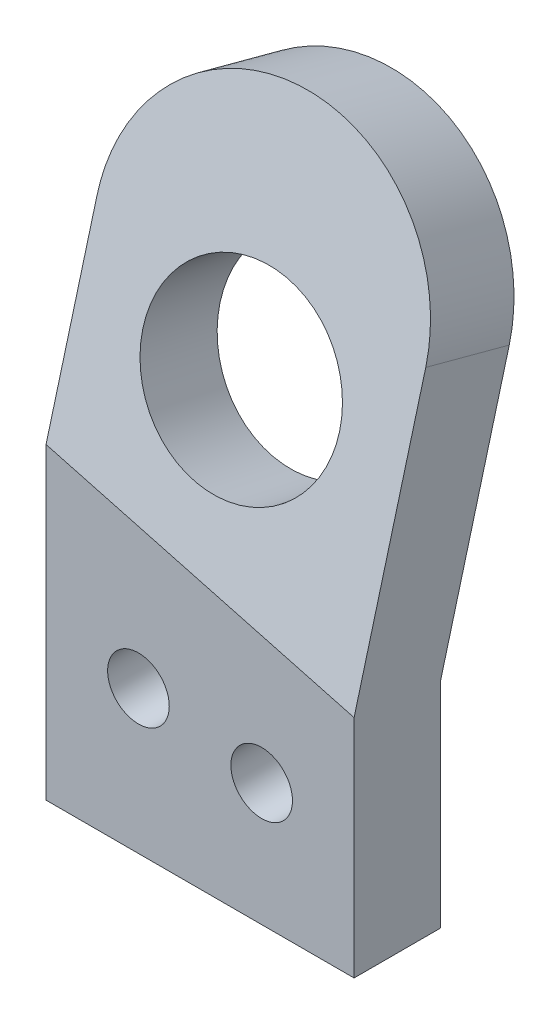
ISO-10303-21;
HEADER;
FILE_DESCRIPTION(('STEP AP214'),'2;1');
FILE_NAME('part.step','',(''),(''),'','','');
FILE_SCHEMA(('AUTOMOTIVE_DESIGN { 1 0 10303 214 1 1 1 1 }'));
ENDSEC;
DATA;
#1=APPLICATION_CONTEXT('core data for automotive mechanical design processes');
#2=APPLICATION_PROTOCOL_DEFINITION('international standard','automotive_design',2000,#1);
#3=PRODUCT_CONTEXT('',#1,'mechanical');
#4=PRODUCT('Part','Part','',(#3));
#5=PRODUCT_RELATED_PRODUCT_CATEGORY('part','',(#4));
#6=PRODUCT_DEFINITION_FORMATION('','',#4);
#7=PRODUCT_DEFINITION_CONTEXT('part definition',#1,'design');
#8=PRODUCT_DEFINITION('design','',#6,#7);
#9=PRODUCT_DEFINITION_SHAPE('','',#8);
#10=(LENGTH_UNIT() NAMED_UNIT(*) SI_UNIT(.MILLI.,.METRE.));
#11=(NAMED_UNIT(*) PLANE_ANGLE_UNIT() SI_UNIT($,.RADIAN.));
#12=(NAMED_UNIT(*) SI_UNIT($,.STERADIAN.) SOLID_ANGLE_UNIT());
#13=UNCERTAINTY_MEASURE_WITH_UNIT(LENGTH_MEASURE(1.E-05),#10,'distance_accuracy_value','');
#14=(GEOMETRIC_REPRESENTATION_CONTEXT(3) GLOBAL_UNCERTAINTY_ASSIGNED_CONTEXT((#13)) GLOBAL_UNIT_ASSIGNED_CONTEXT((#10,
#11,#12)) REPRESENTATION_CONTEXT('',''));
#15=CARTESIAN_POINT('',(0.,0.,0.));
#16=DIRECTION('',(0.,0.,1.));
#17=DIRECTION('',(1.,0.,0.));
#18=AXIS2_PLACEMENT_3D('',#15,#16,#17);
#19=CARTESIAN_POINT('',(-25.,26.3799971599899,-0.187016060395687));
#20=DIRECTION('',(0.,0.258819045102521,0.965925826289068));
#21=DIRECTION('',(0.,-0.965925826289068,0.258819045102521));
#22=AXIS2_PLACEMENT_3D('',#19,#20,#21);
#23=CYLINDRICAL_SURFACE('',#22,25.);
#24=DIRECTION('',(0.,-0.258819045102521,-0.965925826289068));
#25=VECTOR('',#24,1.);
#26=CARTESIAN_POINT('',(0.,26.3799971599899,-0.187016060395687));
#27=LINE('',#26,#25);
#28=CARTESIAN_POINT('',(0.,26.3799971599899,-0.187016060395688));
#29=VERTEX_POINT('',#28);
#30=CARTESIAN_POINT('',(0.,30.0121668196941,13.3684256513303));
#31=VERTEX_POINT('',#30);
#32=EDGE_CURVE('E125',#29,#31,#27,.F.);
#33=ORIENTED_EDGE('',*,*,#32,.F.);
#34=CARTESIAN_POINT('',(-25.,26.828726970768,1.48766639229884));
#35=DIRECTION('',(0.0691841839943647,0.258198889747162,0.96361137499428));
#36=DIRECTION('',(-0.997603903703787,0.0179061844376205,0.0668267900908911));
#37=AXIS2_PLACEMENT_3D('',#34,#35,#36);
#38=ELLIPSE('',#37,25.0600462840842,25.);
#39=CARTESIAN_POINT('',(-50.,27.2774567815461,3.16234884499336));
#40=VERTEX_POINT('',#39);
#41=EDGE_CURVE('E41',#40,#29,#38,.F.);
#42=ORIENTED_EDGE('',*,*,#41,.F.);
#43=DIRECTION('',(0.,0.258819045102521,0.965925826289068));
#44=VECTOR('',#43,1.);
#45=CARTESIAN_POINT('',(-50.,21.3102615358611,-19.1075269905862));
#46=LINE('',#45,#44);
#47=CARTESIAN_POINT('',(-50.,30.9096264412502,16.7177905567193));
#48=VERTEX_POINT('',#47);
#49=EDGE_CURVE('E128',#48,#40,#46,.F.);
#50=ORIENTED_EDGE('',*,*,#49,.F.);
#51=CARTESIAN_POINT('',(-25.,30.4608966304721,15.0431081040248));
#52=DIRECTION('',(0.0691841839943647,0.258198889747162,0.96361137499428));
#53=DIRECTION('',(-0.997603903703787,0.0179061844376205,0.0668267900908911));
#54=AXIS2_PLACEMENT_3D('',#51,#52,#53);
#55=ELLIPSE('',#54,25.0600462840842,25.);
#56=EDGE_CURVE('E11',#31,#48,#55,.T.);
#57=ORIENTED_EDGE('',*,*,#56,.F.);
#58=EDGE_LOOP('',(#33,#42,#50,#57));
#59=FACE_BOUND('',#58,.T.);
#60=ADVANCED_FACE('F33',(#59),#23,.T.);
#61=CARTESIAN_POINT('',(0.,-50.,0.));
#62=DIRECTION('',(-1.,0.,0.));
#63=DIRECTION('',(0.,0.,1.));
#64=AXIS2_PLACEMENT_3D('',#61,#62,#63);
#65=PLANE('',#64);
#66=DIRECTION('',(0.,-0.965925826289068,0.258819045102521));
#67=VECTOR('',#66,1.);
#68=CARTESIAN_POINT('',(0.,-17.0296292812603,11.444558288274));
#69=LINE('',#68,#67);
#70=CARTESIAN_POINT('',(0.,-15.3705151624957,11.));
#71=VERTEX_POINT('',#70);
#72=EDGE_CURVE('E96',#29,#71,#69,.T.);
#73=ORIENTED_EDGE('',*,*,#72,.F.);
#74=ORIENTED_EDGE('',*,*,#32,.T.);
#75=DIRECTION('',(0.,-0.965925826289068,0.258819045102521));
#76=VECTOR('',#75,1.);
#77=CARTESIAN_POINT('',(0.,-13.3974596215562,25.));
#78=LINE('',#77,#76);
#79=CARTESIAN_POINT('',(0.,-13.3974596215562,25.));
#80=VERTEX_POINT('',#79);
#81=EDGE_CURVE('E116',#31,#80,#78,.T.);
#82=ORIENTED_EDGE('',*,*,#81,.T.);
#83=DIRECTION('',(0.,-1.,0.));
#84=VECTOR('',#83,1.);
#85=CARTESIAN_POINT('',(0.,-50.,25.));
#86=LINE('',#85,#84);
#87=CARTESIAN_POINT('',(0.,-50.,25.));
#88=VERTEX_POINT('',#87);
#89=EDGE_CURVE('E110',#80,#88,#86,.T.);
#90=ORIENTED_EDGE('',*,*,#89,.T.);
#91=DIRECTION('',(0.,0.,-1.));
#92=VECTOR('',#91,1.);
#93=CARTESIAN_POINT('',(0.,-50.,0.));
#94=LINE('',#93,#92);
#95=CARTESIAN_POINT('',(0.,-50.,11.));
#96=VERTEX_POINT('',#95);
#97=EDGE_CURVE('E102',#88,#96,#94,.T.);
#98=ORIENTED_EDGE('',*,*,#97,.T.);
#99=DIRECTION('',(0.,-1.,0.));
#100=VECTOR('',#99,1.);
#101=CARTESIAN_POINT('',(0.,-50.,11.));
#102=LINE('',#101,#100);
#103=EDGE_CURVE('E84',#71,#96,#102,.T.);
#104=ORIENTED_EDGE('',*,*,#103,.F.);
#105=EDGE_LOOP('',(#73,#74,#82,#90,#98,#104));
#106=FACE_BOUND('',#105,.T.);
#107=ADVANCED_FACE('F108',(#106),#65,.F.);
#108=CARTESIAN_POINT('',(-50.,-50.,0.));
#109=DIRECTION('',(0.,-1.,0.));
#110=DIRECTION('',(0.,0.,-1.));
#111=AXIS2_PLACEMENT_3D('',#108,#109,#110);
#112=PLANE('',#111);
#113=DIRECTION('',(0.,0.,-1.));
#114=VECTOR('',#113,1.);
#115=CARTESIAN_POINT('',(-50.,-50.,0.));
#116=LINE('',#115,#114);
#117=CARTESIAN_POINT('',(-50.,-50.,25.));
#118=VERTEX_POINT('',#117);
#119=CARTESIAN_POINT('',(-50.,-50.,11.));
#120=VERTEX_POINT('',#119);
#121=EDGE_CURVE('E104',#118,#120,#116,.T.);
#122=ORIENTED_EDGE('',*,*,#121,.T.);
#123=DIRECTION('',(1.,0.,0.));
#124=VECTOR('',#123,1.);
#125=CARTESIAN_POINT('',(-50.,-50.,11.));
#126=LINE('',#125,#124);
#127=EDGE_CURVE('E88',#120,#96,#126,.T.);
#128=ORIENTED_EDGE('',*,*,#127,.T.);
#129=ORIENTED_EDGE('',*,*,#97,.F.);
#130=DIRECTION('',(1.,0.,0.));
#131=VECTOR('',#130,1.);
#132=CARTESIAN_POINT('',(-50.,-50.,25.));
#133=LINE('',#132,#131);
#134=EDGE_CURVE('E123',#118,#88,#133,.T.);
#135=ORIENTED_EDGE('',*,*,#134,.F.);
#136=EDGE_LOOP('',(#122,#128,#129,#135));
#137=FACE_BOUND('',#136,.T.);
#138=ADVANCED_FACE('F101',(#137),#112,.T.);
#139=CARTESIAN_POINT('',(-50.,-50.,0.));
#140=DIRECTION('',(-1.,0.,0.));
#141=DIRECTION('',(0.,0.,1.));
#142=AXIS2_PLACEMENT_3D('',#139,#140,#141);
#143=PLANE('',#142);
#144=DIRECTION('',(0.,-0.965925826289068,0.258819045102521));
#145=VECTOR('',#144,1.);
#146=CARTESIAN_POINT('',(-50.,0.,25.));
#147=LINE('',#146,#145);
#148=CARTESIAN_POINT('',(-50.,0.,25.));
#149=VERTEX_POINT('',#148);
#150=EDGE_CURVE('E112',#48,#149,#147,.T.);
#151=ORIENTED_EDGE('',*,*,#150,.F.);
#152=ORIENTED_EDGE('',*,*,#49,.T.);
#153=DIRECTION('',(0.,-0.965925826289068,0.258819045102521));
#154=VECTOR('',#153,1.);
#155=CARTESIAN_POINT('',(-50.,-16.1321696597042,14.7939231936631));
#156=LINE('',#155,#154);
#157=CARTESIAN_POINT('',(-50.,-1.97305554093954,11.));
#158=VERTEX_POINT('',#157);
#159=EDGE_CURVE('E95',#40,#158,#156,.T.);
#160=ORIENTED_EDGE('',*,*,#159,.T.);
#161=DIRECTION('',(0.,-1.,0.));
#162=VECTOR('',#161,1.);
#163=CARTESIAN_POINT('',(-50.,-50.,11.));
#164=LINE('',#163,#162);
#165=EDGE_CURVE('E106',#158,#120,#164,.T.);
#166=ORIENTED_EDGE('',*,*,#165,.T.);
#167=ORIENTED_EDGE('',*,*,#121,.F.);
#168=DIRECTION('',(0.,-1.,0.));
#169=VECTOR('',#168,1.);
#170=CARTESIAN_POINT('',(-50.,-50.,25.));
#171=LINE('',#170,#169);
#172=EDGE_CURVE('E114',#149,#118,#171,.T.);
#173=ORIENTED_EDGE('',*,*,#172,.F.);
#174=EDGE_LOOP('',(#151,#152,#160,#166,#167,#173));
#175=FACE_BOUND('',#174,.T.);
#176=ADVANCED_FACE('F161',(#175),#143,.T.);
#177=CARTESIAN_POINT('',(-50.,-50.,25.));
#178=DIRECTION('',(0.,0.,1.));
#179=DIRECTION('',(1.,0.,0.));
#180=AXIS2_PLACEMENT_3D('',#177,#178,#179);
#181=PLANE('',#180);
#182=CARTESIAN_POINT('',(-35.,-26.7953138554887,25.));
#183=DIRECTION('',(0.,0.,1.));
#184=DIRECTION('',(1.,0.,0.));
#185=AXIS2_PLACEMENT_3D('',#182,#183,#184);
#186=CIRCLE('',#185,5.);
#187=CARTESIAN_POINT('',(-30.,-26.7953138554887,25.));
#188=VERTEX_POINT('',#187);
#189=EDGE_CURVE('E146',#188,#188,#186,.T.);
#190=ORIENTED_EDGE('',*,*,#189,.F.);
#191=EDGE_LOOP('',(#190));
#192=FACE_BOUND('',#191,.T.);
#193=CARTESIAN_POINT('',(-15.,-30.083745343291,25.));
#194=DIRECTION('',(0.,0.,1.));
#195=DIRECTION('',(1.,0.,0.));
#196=AXIS2_PLACEMENT_3D('',#193,#194,#195);
#197=CIRCLE('',#196,5.);
#198=CARTESIAN_POINT('',(-10.,-30.083745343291,25.));
#199=VERTEX_POINT('',#198);
#200=EDGE_CURVE('E136',#199,#199,#197,.T.);
#201=ORIENTED_EDGE('',*,*,#200,.F.);
#202=EDGE_LOOP('',(#201));
#203=FACE_BOUND('',#202,.T.);
#204=ORIENTED_EDGE('',*,*,#89,.F.);
#205=DIRECTION('',(-0.965925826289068,0.258819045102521,0.));
#206=VECTOR('',#205,1.);
#207=CARTESIAN_POINT('',(-50.,0.,25.));
#208=LINE('',#207,#206);
#209=EDGE_CURVE('E105',#80,#149,#208,.T.);
#210=ORIENTED_EDGE('',*,*,#209,.T.);
#211=ORIENTED_EDGE('',*,*,#172,.T.);
#212=ORIENTED_EDGE('',*,*,#134,.T.);
#213=EDGE_LOOP('',(#204,#210,#211,#212));
#214=FACE_BOUND('',#213,.T.);
#215=ADVANCED_FACE('F159',(#192,#203,#214),#181,.T.);
#216=CARTESIAN_POINT('',(0.,-13.3974596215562,25.));
#217=DIRECTION('',(0.0691841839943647,0.258198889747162,0.96361137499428));
#218=DIRECTION('',(0.,-0.965925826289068,0.258819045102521));
#219=AXIS2_PLACEMENT_3D('',#216,#217,#218);
#220=PLANE('',#219);
#221=CARTESIAN_POINT('',(-25.,18.2413677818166,18.3173209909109));
#222=DIRECTION('',(0.0691841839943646,0.258198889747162,0.96361137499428));
#223=DIRECTION('',(0.,-0.965925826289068,0.258819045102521));
#224=AXIS2_PLACEMENT_3D('',#221,#222,#223);
#225=CIRCLE('',#224,15.);
#226=CARTESIAN_POINT('',(-25.,3.75248038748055,22.1996066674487));
#227=VERTEX_POINT('',#226);
#228=EDGE_CURVE('E133',#227,#227,#225,.T.);
#229=ORIENTED_EDGE('',*,*,#228,.F.);
#230=EDGE_LOOP('',(#229));
#231=FACE_BOUND('',#230,.T.);
#232=ORIENTED_EDGE('',*,*,#81,.F.);
#233=ORIENTED_EDGE('',*,*,#56,.T.);
#234=ORIENTED_EDGE('',*,*,#150,.T.);
#235=ORIENTED_EDGE('',*,*,#209,.F.);
#236=EDGE_LOOP('',(#232,#233,#234,#235));
#237=FACE_BOUND('',#236,.T.);
#238=ADVANCED_FACE('F155',(#231,#237),#220,.T.);
#239=CARTESIAN_POINT('',(-50.,-50.,11.));
#240=DIRECTION('',(0.,0.,1.));
#241=DIRECTION('',(1.,0.,0.));
#242=AXIS2_PLACEMENT_3D('',#239,#240,#241);
#243=PLANE('',#242);
#244=CARTESIAN_POINT('',(-35.,-26.7953138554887,11.));
#245=DIRECTION('',(0.,0.,1.));
#246=DIRECTION('',(1.,0.,0.));
#247=AXIS2_PLACEMENT_3D('',#244,#245,#246);
#248=CIRCLE('',#247,4.99999999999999);
#249=CARTESIAN_POINT('',(-30.,-26.7953138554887,11.));
#250=VERTEX_POINT('',#249);
#251=EDGE_CURVE('E36',#250,#250,#248,.T.);
#252=ORIENTED_EDGE('',*,*,#251,.T.);
#253=EDGE_LOOP('',(#252));
#254=FACE_BOUND('',#253,.T.);
#255=CARTESIAN_POINT('',(-15.,-30.083745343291,11.));
#256=DIRECTION('',(0.,0.,1.));
#257=DIRECTION('',(1.,0.,0.));
#258=AXIS2_PLACEMENT_3D('',#255,#256,#257);
#259=CIRCLE('',#258,4.99999999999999);
#260=CARTESIAN_POINT('',(-10.,-30.083745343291,11.));
#261=VERTEX_POINT('',#260);
#262=EDGE_CURVE('E134',#261,#261,#259,.T.);
#263=ORIENTED_EDGE('',*,*,#262,.T.);
#264=EDGE_LOOP('',(#263));
#265=FACE_BOUND('',#264,.T.);
#266=ORIENTED_EDGE('',*,*,#103,.T.);
#267=ORIENTED_EDGE('',*,*,#127,.F.);
#268=ORIENTED_EDGE('',*,*,#165,.F.);
#269=DIRECTION('',(-0.965925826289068,0.258819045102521,0.));
#270=VECTOR('',#269,1.);
#271=CARTESIAN_POINT('',(-37.9932638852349,-5.19025078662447,11.));
#272=LINE('',#271,#270);
#273=EDGE_CURVE('E91',#71,#158,#272,.T.);
#274=ORIENTED_EDGE('',*,*,#273,.F.);
#275=EDGE_LOOP('',(#266,#267,#268,#274));
#276=FACE_BOUND('',#275,.T.);
#277=ADVANCED_FACE('F86',(#254,#265,#276),#243,.F.);
#278=CARTESIAN_POINT('',(-0.968578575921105,-17.0122440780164,11.5094407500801));
#279=DIRECTION('',(0.0691841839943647,0.258198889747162,0.96361137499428));
#280=DIRECTION('',(0.,-0.965925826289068,0.258819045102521));
#281=AXIS2_PLACEMENT_3D('',#278,#279,#280);
#282=PLANE('',#281);
#283=CARTESIAN_POINT('',(-25.9685785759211,14.6265833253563,4.82676174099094));
#284=DIRECTION('',(0.0691841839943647,0.258198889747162,0.96361137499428));
#285=DIRECTION('',(0.,-0.965925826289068,0.258819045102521));
#286=AXIS2_PLACEMENT_3D('',#283,#284,#285);
#287=CIRCLE('',#286,15.);
#288=CARTESIAN_POINT('',(-25.9685785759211,0.137695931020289,8.70904741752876));
#289=VERTEX_POINT('',#288);
#290=EDGE_CURVE('E131',#289,#289,#287,.T.);
#291=ORIENTED_EDGE('',*,*,#290,.T.);
#292=EDGE_LOOP('',(#291));
#293=FACE_BOUND('',#292,.T.);
#294=ORIENTED_EDGE('',*,*,#159,.F.);
#295=ORIENTED_EDGE('',*,*,#41,.T.);
#296=ORIENTED_EDGE('',*,*,#72,.T.);
#297=ORIENTED_EDGE('',*,*,#273,.T.);
#298=EDGE_LOOP('',(#294,#295,#296,#297));
#299=FACE_BOUND('',#298,.T.);
#300=ADVANCED_FACE('F164',(#293,#299),#282,.F.);
#301=CARTESIAN_POINT('',(-27.906231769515,7.39516315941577,-22.1612657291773));
#302=DIRECTION('',(0.0691841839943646,0.258198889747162,0.96361137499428));
#303=DIRECTION('',(0.,-0.965925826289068,0.258819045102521));
#304=AXIS2_PLACEMENT_3D('',#301,#302,#303);
#305=CYLINDRICAL_SURFACE('',#304,15.);
#306=ORIENTED_EDGE('',*,*,#228,.T.);
#307=EDGE_LOOP('',(#306));
#308=FACE_BOUND('',#307,.T.);
#309=ORIENTED_EDGE('',*,*,#290,.F.);
#310=EDGE_LOOP('',(#309));
#311=FACE_BOUND('',#310,.T.);
#312=ADVANCED_FACE('F200',(#308,#311),#305,.F.);
#313=CARTESIAN_POINT('',(-15.,-30.083745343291,25.));
#314=DIRECTION('',(0.,0.,1.));
#315=DIRECTION('',(1.,0.,0.));
#316=AXIS2_PLACEMENT_3D('',#313,#314,#315);
#317=CYLINDRICAL_SURFACE('',#316,4.99999999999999);
#318=ORIENTED_EDGE('',*,*,#200,.T.);
#319=EDGE_LOOP('',(#318));
#320=FACE_BOUND('',#319,.T.);
#321=ORIENTED_EDGE('',*,*,#262,.F.);
#322=EDGE_LOOP('',(#321));
#323=FACE_BOUND('',#322,.T.);
#324=ADVANCED_FACE('F191',(#320,#323),#317,.F.);
#325=CARTESIAN_POINT('',(-35.,-26.7953138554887,25.));
#326=DIRECTION('',(0.,0.,1.));
#327=DIRECTION('',(1.,0.,0.));
#328=AXIS2_PLACEMENT_3D('',#325,#326,#327);
#329=CYLINDRICAL_SURFACE('',#328,4.99999999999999);
#330=ORIENTED_EDGE('',*,*,#189,.T.);
#331=EDGE_LOOP('',(#330));
#332=FACE_BOUND('',#331,.T.);
#333=ORIENTED_EDGE('',*,*,#251,.F.);
#334=EDGE_LOOP('',(#333));
#335=FACE_BOUND('',#334,.T.);
#336=ADVANCED_FACE('F188',(#332,#335),#329,.F.);
#337=CLOSED_SHELL('',(#60,#107,#138,#176,#215,#238,#277,#300,#312,#324,#336));
#338=MANIFOLD_SOLID_BREP('B2',#337);
#339=ADVANCED_BREP_SHAPE_REPRESENTATION('',(#18,#338),#14);
#340=SHAPE_DEFINITION_REPRESENTATION(#9,#339);
ENDSEC;
END-ISO-10303-21;
